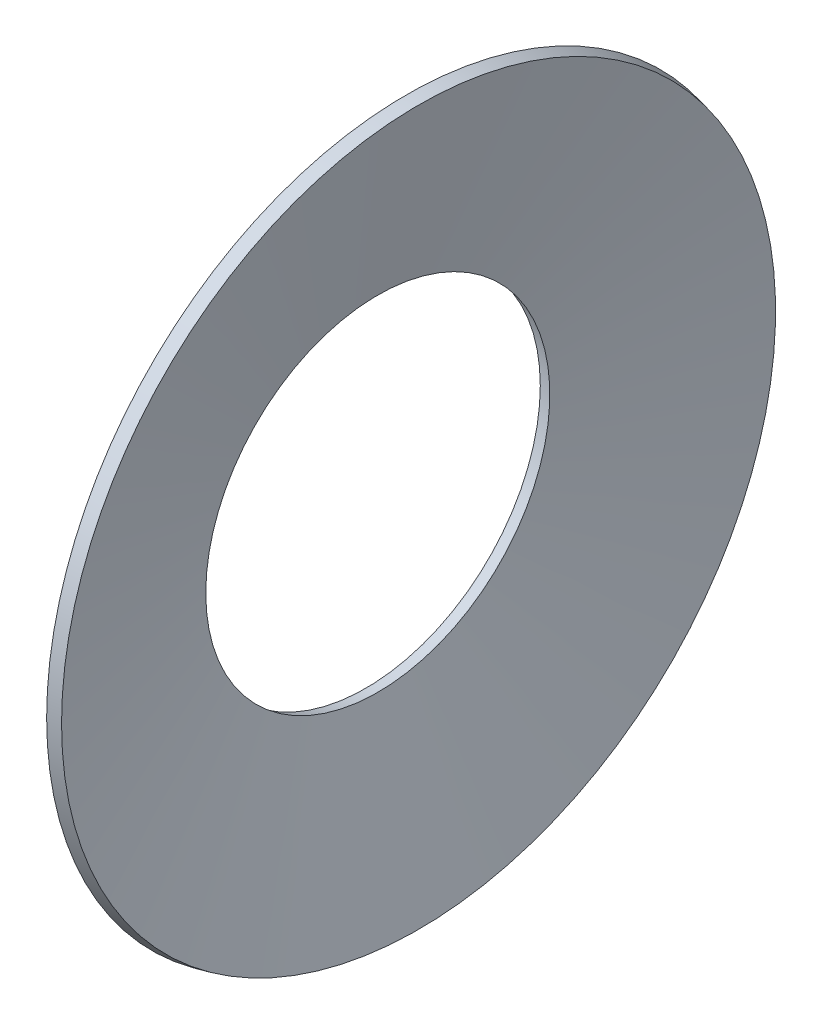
from build123d import *


with BuildPart() as part:
    # Esquisse1 → Base-R_volution (revolve)
    with BuildSketch(Plane.XY, mode=Mode.PRIVATE) as base_r_volution_sk:
        Polygon((0, 5.58609051), (1.303374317, 11.5), (1.694, 11.41390949), (0.390625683, 5.5), align=None)
    revolve(base_r_volution_sk.sketch.rotate(Axis((0, 0, 0), (1, 0, 0)), 90), axis=Axis((0, 0, 0), (1, 0, 0)))


solid = part.part
